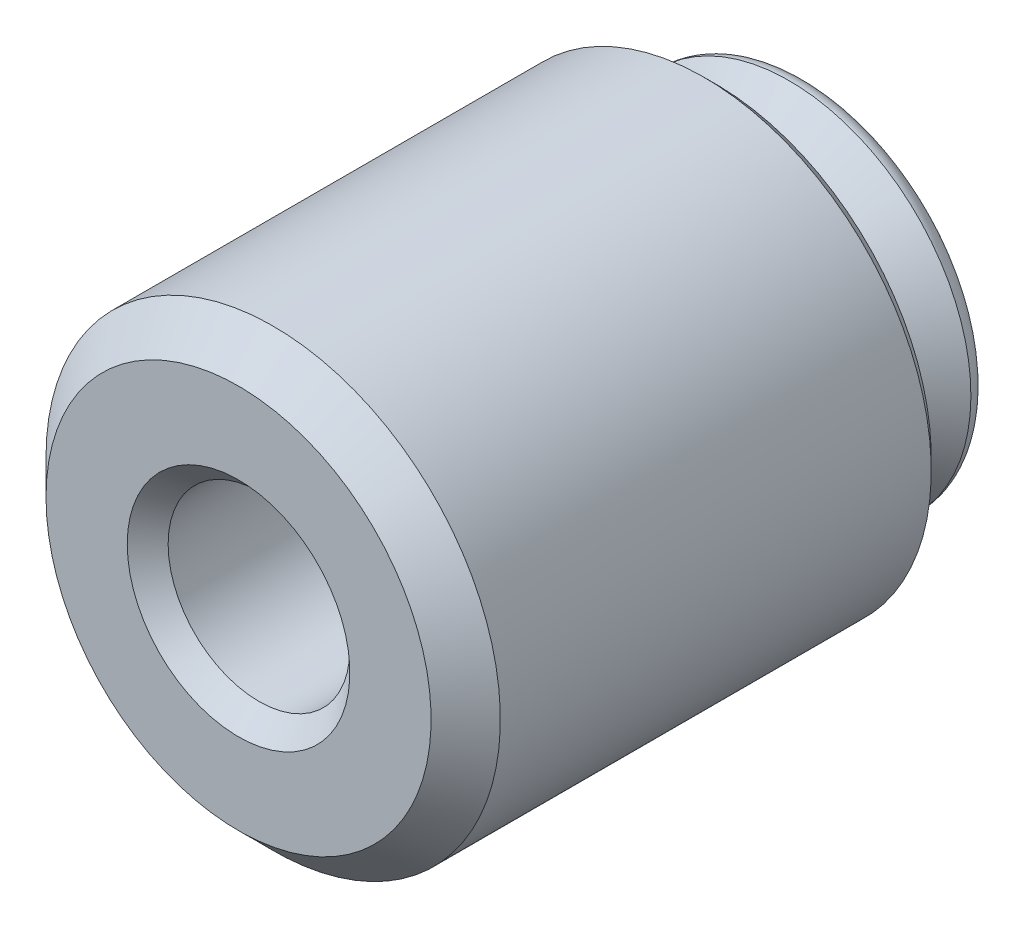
ISO-10303-21;
HEADER;
FILE_DESCRIPTION(('STEP AP214'),'2;1');
FILE_NAME('part.step','',(''),(''),'','','');
FILE_SCHEMA(('AUTOMOTIVE_DESIGN { 1 0 10303 214 1 1 1 1 }'));
ENDSEC;
DATA;
#1=APPLICATION_CONTEXT('core data for automotive mechanical design processes');
#2=APPLICATION_PROTOCOL_DEFINITION('international standard','automotive_design',2000,#1);
#3=PRODUCT_CONTEXT('',#1,'mechanical');
#4=PRODUCT('Part','Part','',(#3));
#5=PRODUCT_RELATED_PRODUCT_CATEGORY('part','',(#4));
#6=PRODUCT_DEFINITION_FORMATION('','',#4);
#7=PRODUCT_DEFINITION_CONTEXT('part definition',#1,'design');
#8=PRODUCT_DEFINITION('design','',#6,#7);
#9=PRODUCT_DEFINITION_SHAPE('','',#8);
#10=(LENGTH_UNIT() NAMED_UNIT(*) SI_UNIT(.MILLI.,.METRE.));
#11=(NAMED_UNIT(*) PLANE_ANGLE_UNIT() SI_UNIT($,.RADIAN.));
#12=(NAMED_UNIT(*) SI_UNIT($,.STERADIAN.) SOLID_ANGLE_UNIT());
#13=UNCERTAINTY_MEASURE_WITH_UNIT(LENGTH_MEASURE(1.E-05),#10,'distance_accuracy_value','');
#14=(GEOMETRIC_REPRESENTATION_CONTEXT(3) GLOBAL_UNCERTAINTY_ASSIGNED_CONTEXT((#13)) GLOBAL_UNIT_ASSIGNED_CONTEXT((#10,
#11,#12)) REPRESENTATION_CONTEXT('',''));
#15=CARTESIAN_POINT('',(0.,0.,0.));
#16=DIRECTION('',(0.,0.,1.));
#17=DIRECTION('',(1.,0.,0.));
#18=AXIS2_PLACEMENT_3D('',#15,#16,#17);
#19=CARTESIAN_POINT('',(0.,0.,4.0013999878));
#20=DIRECTION('',(0.,0.,-1.));
#21=DIRECTION('',(0.0518889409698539,0.99865286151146,0.));
#22=AXIS2_PLACEMENT_3D('',#19,#20,#21);
#23=SPHERICAL_SURFACE('',#22,3.5);
#24=CARTESIAN_POINT('',(0.,0.,2.6349999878));
#25=DIRECTION('',(0.,0.,-1.));
#26=DIRECTION('',(-1.,0.,0.));
#27=AXIS2_PLACEMENT_3D('',#24,#25,#26);
#28=CIRCLE('',#27,3.2222586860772);
#29=CARTESIAN_POINT('',(0.167199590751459,3.21791785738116,2.6349999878));
#30=VERTEX_POINT('',#29);
#31=EDGE_CURVE('E8',#30,#30,#28,.F.);
#32=CARTESIAN_POINT('',(0.,0.,2.25615730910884));
#33=DIRECTION('',(0.,0.,1.));
#34=DIRECTION('',(0.0518889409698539,0.99865286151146,0.));
#35=AXIS2_PLACEMENT_3D('',#32,#33,#34);
#36=CIRCLE('',#35,3.0338305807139);
#37=CARTESIAN_POINT('',(0.157422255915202,3.02974359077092,2.25615730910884));
#38=VERTEX_POINT('',#37);
#39=EDGE_CURVE('E39',#38,#38,#36,.T.);
#40=CARTESIAN_POINT('',(0.167199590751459,3.21791785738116,2.6349999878));
#41=CARTESIAN_POINT('',(0.167110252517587,3.21619845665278,2.63093980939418));
#42=CARTESIAN_POINT('',(0.167020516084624,3.2144713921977,2.62688288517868));
#43=CARTESIAN_POINT('',(0.166840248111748,3.21100196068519,2.61877560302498));
#44=CARTESIAN_POINT('',(0.166749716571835,3.20925959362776,2.61472524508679));
#45=CARTESIAN_POINT('',(0.166567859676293,3.20575958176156,2.60663115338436));
#46=CARTESIAN_POINT('',(0.166476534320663,3.20400193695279,2.60258741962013));
#47=CARTESIAN_POINT('',(0.166293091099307,3.20047139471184,2.59450663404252));
#48=CARTESIAN_POINT('',(0.166200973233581,3.19869849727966,2.59046958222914));
#49=CARTESIAN_POINT('',(0.16601594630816,3.19513747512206,2.58240221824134));
#50=CARTESIAN_POINT('',(0.165923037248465,3.19334935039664,2.57837190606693));
#51=CARTESIAN_POINT('',(0.165736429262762,3.18975789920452,2.57031807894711));
#52=CARTESIAN_POINT('',(0.165642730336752,3.18795457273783,2.56629456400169));
#53=CARTESIAN_POINT('',(0.1654545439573,3.18433274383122,2.55825438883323));
#54=CARTESIAN_POINT('',(0.165360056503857,3.18251424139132,2.55423772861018));
#55=CARTESIAN_POINT('',(0.165170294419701,3.17886208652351,2.54621132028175));
#56=CARTESIAN_POINT('',(0.165075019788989,3.17702843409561,2.54220157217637));
#57=CARTESIAN_POINT('',(0.164883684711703,3.17334600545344,2.53418904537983));
#58=CARTESIAN_POINT('',(0.164787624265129,3.17149722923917,2.53018626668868));
#59=CARTESIAN_POINT('',(0.164594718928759,3.167784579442,2.52218773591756));
#60=CARTESIAN_POINT('',(0.164497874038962,3.1659207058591,2.5181919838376));
#61=CARTESIAN_POINT('',(0.164303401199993,3.16217788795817,2.51020756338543));
#62=CARTESIAN_POINT('',(0.164205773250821,3.16029894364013,2.50621889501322));
#63=CARTESIAN_POINT('',(0.164009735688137,3.15652601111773,2.4982486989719));
#64=CARTESIAN_POINT('',(0.163911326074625,3.15463202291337,2.49426717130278));
#65=CARTESIAN_POINT('',(0.163713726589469,3.15082902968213,2.48631131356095));
#66=CARTESIAN_POINT('',(0.163614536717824,3.14892002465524,2.48233698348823));
#67=CARTESIAN_POINT('',(0.163415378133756,3.14508702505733,2.47439557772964));
#68=CARTESIAN_POINT('',(0.163315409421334,3.1431630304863,2.47042850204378));
#69=CARTESIAN_POINT('',(0.163114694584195,3.13930007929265,2.46250166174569));
#70=CARTESIAN_POINT('',(0.163013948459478,3.13736112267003,2.45854189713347));
#71=CARTESIAN_POINT('',(0.162811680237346,3.13346827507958,2.45062973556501));
#72=CARTESIAN_POINT('',(0.162710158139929,3.13151438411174,2.44667733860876));
#73=CARTESIAN_POINT('',(0.162506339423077,3.1275916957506,2.43877996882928));
#74=CARTESIAN_POINT('',(0.162404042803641,3.12562289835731,2.43483499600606));
#75=CARTESIAN_POINT('',(0.1621986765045,3.12167042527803,2.42695253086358));
#76=CARTESIAN_POINT('',(0.162095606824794,3.11968674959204,2.42301503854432));
#77=CARTESIAN_POINT('',(0.161888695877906,3.11570454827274,2.41514759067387));
#78=CARTESIAN_POINT('',(0.161784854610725,3.11370602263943,2.41121763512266));
#79=CARTESIAN_POINT('',(0.161576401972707,3.10969414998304,2.40336531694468));
#80=CARTESIAN_POINT('',(0.161471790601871,3.10768080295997,2.39944295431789));
#81=CARTESIAN_POINT('',(0.161261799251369,3.10363931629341,2.39160587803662));
#82=CARTESIAN_POINT('',(0.161156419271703,3.10161117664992,2.38769116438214));
#83=CARTESIAN_POINT('',(0.160944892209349,3.09754013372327,2.37986944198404));
#84=CARTESIAN_POINT('',(0.160838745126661,3.0954972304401,2.37596243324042));
#85=CARTESIAN_POINT('',(0.160625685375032,3.09139668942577,2.36815617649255));
#86=CARTESIAN_POINT('',(0.160518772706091,3.0893390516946,2.36425692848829));
#87=CARTESIAN_POINT('',(0.160304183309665,3.08520907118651,2.35646624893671));
#88=CARTESIAN_POINT('',(0.16019650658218,3.08313672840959,2.35257481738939));
#89=CARTESIAN_POINT('',(0.159980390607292,3.07897736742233,2.34479982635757));
#90=CARTESIAN_POINT('',(0.159871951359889,3.076890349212,2.34091626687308));
#91=CARTESIAN_POINT('',(0.15965431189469,3.07270166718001,2.33315707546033));
#92=CARTESIAN_POINT('',(0.159545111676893,3.07060000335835,2.32928144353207));
#93=CARTESIAN_POINT('',(0.159325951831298,3.06638206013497,2.32153816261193));
#94=CARTESIAN_POINT('',(0.1592159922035,3.06426578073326,2.31767051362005));
#95=CARTESIAN_POINT('',(0.158995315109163,3.0600186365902,2.30994325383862));
#96=CARTESIAN_POINT('',(0.158884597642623,3.05788777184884,2.30608364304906));
#97=CARTESIAN_POINT('',(0.158662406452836,3.05361148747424,2.29837251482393));
#98=CARTESIAN_POINT('',(0.158550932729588,3.051466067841,2.29452099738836));
#99=CARTESIAN_POINT('',(0.15832723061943,3.04716070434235,2.28682611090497));
#100=CARTESIAN_POINT('',(0.15821500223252,3.04500076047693,2.28298274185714));
#101=CARTESIAN_POINT('',(0.157989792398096,3.04066637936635,2.27530420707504));
#102=CARTESIAN_POINT('',(0.157876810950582,3.03849194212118,2.27146904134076));
#103=CARTESIAN_POINT('',(0.157650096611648,3.03412860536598,2.26380696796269));
#104=CARTESIAN_POINT('',(0.157536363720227,3.03193970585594,2.2599800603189));
#105=CARTESIAN_POINT('',(0.157422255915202,3.02974359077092,2.25615730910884));
#106=B_SPLINE_CURVE_WITH_KNOTS('',3,(#40,#41,#42,#43,#44,#45,#46,#47,#48,#49,#50,#51,#52,#53,
#54,#55,#56,#57,#58,#59,#60,#61,#62,#63,#64,#65,#66,#67,#68,#69,#70,#71,#72,#73,#74,#75,#76,#77,
#78,#79,#80,#81,#82,#83,#84,#85,#86,#87,#88,#89,#90,#91,#92,#93,#94,#95,#96,#97,#98,#99,#100,
#101,#102,#103,#104,#105),.UNSPECIFIED.,.F.,.F.,(4,2,2,2,2,2,2,2,2,2,2,2,2,2,2,2,2,2,2,2,2,2,2,
2,2,2,2,2,2,2,2,2,4),(0.,0.0132304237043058,0.0264608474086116,0.0396912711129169,
0.0529216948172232,0.0661521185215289,0.0793825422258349,0.0926129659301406,0.105843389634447,
0.119073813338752,0.132304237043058,0.145534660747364,0.158765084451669,0.171995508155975,
0.185225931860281,0.198456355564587,0.211686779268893,0.224917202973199,0.238147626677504,
0.25137805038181,0.264608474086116,0.277838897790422,0.291069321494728,0.304299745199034,
0.317530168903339,0.330760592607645,0.343991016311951,0.357221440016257,0.370451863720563,
0.383682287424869,0.396912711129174,0.41014313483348,0.423373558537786),.UNSPECIFIED.);
#107=EDGE_CURVE('BSEAM12',#30,#38,#106,.T.);
#108=ORIENTED_EDGE('',*,*,#31,.F.);
#109=ORIENTED_EDGE('',*,*,#39,.T.);
#110=ORIENTED_EDGE('',*,*,#107,.T.);
#111=ORIENTED_EDGE('',*,*,#107,.F.);
#112=EDGE_LOOP('',(#108,#110,#109,#111));
#113=FACE_BOUND('',#112,.T.);
#114=ADVANCED_FACE('F12',(#113),#23,.T.);
#115=CARTESIAN_POINT('',(0.,0.,0.));
#116=DIRECTION('',(0.,0.,-1.));
#117=DIRECTION('',(-0.0518889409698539,-0.99865286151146,0.));
#118=AXIS2_PLACEMENT_3D('',#115,#116,#117);
#119=CYLINDRICAL_SURFACE('',#118,3.);
#120=CARTESIAN_POINT('',(0.,0.,2.1295025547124));
#121=DIRECTION('',(0.,0.,1.));
#122=DIRECTION('',(0.0518889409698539,0.99865286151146,0.));
#123=AXIS2_PLACEMENT_3D('',#120,#121,#122);
#124=CIRCLE('',#123,3.);
#125=CARTESIAN_POINT('',(0.155666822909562,2.99595858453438,2.1295025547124));
#126=VERTEX_POINT('',#125);
#127=EDGE_CURVE('E37',#126,#126,#124,.F.);
#128=ORIENTED_EDGE('',*,*,#127,.T.);
#129=EDGE_LOOP('',(#128));
#130=FACE_BOUND('',#129,.T.);
#131=CARTESIAN_POINT('',(0.,0.,1.48621024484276));
#132=DIRECTION('',(0.,0.,-1.));
#133=DIRECTION('',(-0.0518889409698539,-0.99865286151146,0.));
#134=AXIS2_PLACEMENT_3D('',#131,#132,#133);
#135=CIRCLE('',#134,3.);
#136=CARTESIAN_POINT('',(-0.155666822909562,-2.99595858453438,1.48621024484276));
#137=VERTEX_POINT('',#136);
#138=EDGE_CURVE('E34',#137,#137,#135,.F.);
#139=ORIENTED_EDGE('',*,*,#138,.T.);
#140=EDGE_LOOP('',(#139));
#141=FACE_BOUND('',#140,.T.);
#142=ADVANCED_FACE('F245',(#130,#141),#119,.T.);
#143=CARTESIAN_POINT('',(0.,0.,1.381));
#144=DIRECTION('',(0.,0.,-1.));
#145=DIRECTION('',(-0.0518889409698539,-0.99865286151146,0.));
#146=AXIS2_PLACEMENT_3D('',#143,#144,#145);
#147=CONICAL_SURFACE('',#146,3.,0.78539816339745);
#148=CARTESIAN_POINT('',(0.,0.,1.30660512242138));
#149=DIRECTION('',(0.,0.,-1.));
#150=DIRECTION('',(-0.0518889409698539,-0.99865286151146,0.));
#151=AXIS2_PLACEMENT_3D('',#148,#149,#150);
#152=CIRCLE('',#151,3.07439487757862);
#153=CARTESIAN_POINT('',(-0.159527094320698,-3.07025324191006,1.30660512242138));
#154=VERTEX_POINT('',#153);
#155=EDGE_CURVE('E15',#154,#154,#152,.T.);
#156=ORIENTED_EDGE('',*,*,#155,.T.);
#157=EDGE_LOOP('',(#156));
#158=FACE_BOUND('',#157,.T.);
#159=CARTESIAN_POINT('',(0.,0.,0.381));
#160=DIRECTION('',(0.,0.,-1.));
#161=DIRECTION('',(-0.0518889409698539,-0.99865286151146,0.));
#162=AXIS2_PLACEMENT_3D('',#159,#160,#161);
#163=CIRCLE('',#162,4.);
#164=CARTESIAN_POINT('',(-0.207555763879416,-3.99461144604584,0.381));
#165=VERTEX_POINT('',#164);
#166=EDGE_CURVE('E28',#165,#165,#163,.T.);
#167=ORIENTED_EDGE('',*,*,#166,.F.);
#168=EDGE_LOOP('',(#167));
#169=FACE_BOUND('',#168,.T.);
#170=ADVANCED_FACE('F236',(#158,#169),#147,.T.);
#171=CARTESIAN_POINT('',(0.207555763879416,3.99461144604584,0.));
#172=DIRECTION('',(0.,0.,1.));
#173=DIRECTION('',(0.0518889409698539,0.99865286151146,0.));
#174=AXIS2_PLACEMENT_3D('',#171,#172,#173);
#175=PLANE('',#174);
#176=CARTESIAN_POINT('',(0.,0.,0.));
#177=DIRECTION('',(0.,0.,1.));
#178=DIRECTION('',(0.0518889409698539,0.99865286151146,0.));
#179=AXIS2_PLACEMENT_3D('',#176,#177,#178);
#180=CIRCLE('',#179,3.619);
#181=CARTESIAN_POINT('',(0.187786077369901,3.61412470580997,0.));
#182=VERTEX_POINT('',#181);
#183=EDGE_CURVE('E31',#182,#182,#180,.F.);
#184=ORIENTED_EDGE('',*,*,#183,.T.);
#185=EDGE_LOOP('',(#184));
#186=FACE_BOUND('',#185,.T.);
#187=ADVANCED_FACE('F227',(#186),#175,.F.);
#188=CARTESIAN_POINT('',(0.,0.,0.381));
#189=DIRECTION('',(0.,0.,1.));
#190=DIRECTION('',(0.0518889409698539,0.99865286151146,0.));
#191=AXIS2_PLACEMENT_3D('',#188,#189,#190);
#192=TOROIDAL_SURFACE('',#191,3.619,0.381);
#193=ORIENTED_EDGE('',*,*,#166,.T.);
#194=EDGE_LOOP('',(#193));
#195=FACE_BOUND('',#194,.T.);
#196=ORIENTED_EDGE('',*,*,#183,.F.);
#197=EDGE_LOOP('',(#196));
#198=FACE_BOUND('',#197,.T.);
#199=ADVANCED_FACE('F218',(#195,#198),#192,.T.);
#200=CARTESIAN_POINT('',(0.,0.,2.1295025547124));
#201=DIRECTION('',(0.,0.,1.));
#202=DIRECTION('',(0.0518889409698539,0.99865286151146,0.));
#203=AXIS2_PLACEMENT_3D('',#200,#201,#202);
#204=TOROIDAL_SURFACE('',#203,3.254,0.254);
#205=ORIENTED_EDGE('',*,*,#39,.F.);
#206=EDGE_LOOP('',(#205));
#207=FACE_BOUND('',#206,.T.);
#208=ORIENTED_EDGE('',*,*,#127,.F.);
#209=EDGE_LOOP('',(#208));
#210=FACE_BOUND('',#209,.T.);
#211=ADVANCED_FACE('F102',(#207,#210),#204,.F.);
#212=CARTESIAN_POINT('',(0.,0.,1.48621024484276));
#213=DIRECTION('',(0.,0.,-1.));
#214=DIRECTION('',(-0.0518889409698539,-0.99865286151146,0.));
#215=AXIS2_PLACEMENT_3D('',#212,#213,#214);
#216=TOROIDAL_SURFACE('',#215,3.254,0.254);
#217=ORIENTED_EDGE('',*,*,#138,.F.);
#218=EDGE_LOOP('',(#217));
#219=FACE_BOUND('',#218,.T.);
#220=ORIENTED_EDGE('',*,*,#155,.F.);
#221=EDGE_LOOP('',(#220));
#222=FACE_BOUND('',#221,.T.);
#223=ADVANCED_FACE('F97',(#219,#222),#216,.F.);
#224=CARTESIAN_POINT('',(0.,0.,8.9999999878));
#225=DIRECTION('',(0.,0.,1.));
#226=DIRECTION('',(1.,0.,0.));
#227=AXIS2_PLACEMENT_3D('',#224,#225,#226);
#228=PLANE('',#227);
#229=CARTESIAN_POINT('',(0.,0.,8.9999999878));
#230=DIRECTION('',(0.,0.,1.));
#231=DIRECTION('',(1.,0.,0.));
#232=AXIS2_PLACEMENT_3D('',#229,#230,#231);
#233=CIRCLE('',#232,2.);
#234=CARTESIAN_POINT('',(2.,0.,8.9999999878));
#235=VERTEX_POINT('',#234);
#236=EDGE_CURVE('E44',#235,#235,#233,.T.);
#237=ORIENTED_EDGE('',*,*,#236,.T.);
#238=EDGE_LOOP('',(#237));
#239=FACE_BOUND('',#238,.T.);
#240=ADVANCED_FACE('F91',(#239),#228,.T.);
#241=CARTESIAN_POINT('',(0.,0.,8.9999999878));
#242=DIRECTION('',(0.,0.,1.));
#243=DIRECTION('',(1.,0.,0.));
#244=AXIS2_PLACEMENT_3D('',#241,#242,#243);
#245=CYLINDRICAL_SURFACE('',#244,2.);
#246=CARTESIAN_POINT('',(0.,0.,12.0499999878));
#247=DIRECTION('',(0.,0.,-1.));
#248=DIRECTION('',(-1.,0.,0.));
#249=AXIS2_PLACEMENT_3D('',#246,#247,#248);
#250=CIRCLE('',#249,2.);
#251=CARTESIAN_POINT('',(-2.,0.,12.0499999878));
#252=VERTEX_POINT('',#251);
#253=EDGE_CURVE('E24',#252,#252,#250,.F.);
#254=ORIENTED_EDGE('',*,*,#253,.T.);
#255=EDGE_LOOP('',(#254));
#256=FACE_BOUND('',#255,.T.);
#257=ORIENTED_EDGE('',*,*,#236,.F.);
#258=EDGE_LOOP('',(#257));
#259=FACE_BOUND('',#258,.T.);
#260=ADVANCED_FACE('F75',(#256,#259),#245,.F.);
#261=CARTESIAN_POINT('',(0.,0.,12.0499999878));
#262=DIRECTION('',(0.,0.,1.));
#263=DIRECTION('',(1.,0.,0.));
#264=AXIS2_PLACEMENT_3D('',#261,#262,#263);
#265=CONICAL_SURFACE('',#264,2.,0.78539816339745);
#266=CARTESIAN_POINT('',(0.,0.,12.4999999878));
#267=DIRECTION('',(0.,0.,-1.));
#268=DIRECTION('',(-1.,0.,0.));
#269=AXIS2_PLACEMENT_3D('',#266,#267,#268);
#270=CIRCLE('',#269,2.45);
#271=CARTESIAN_POINT('',(-2.45,0.,12.4999999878));
#272=VERTEX_POINT('',#271);
#273=EDGE_CURVE('E19',#272,#272,#270,.T.);
#274=ORIENTED_EDGE('',*,*,#273,.F.);
#275=EDGE_LOOP('',(#274));
#276=FACE_BOUND('',#275,.T.);
#277=ORIENTED_EDGE('',*,*,#253,.F.);
#278=EDGE_LOOP('',(#277));
#279=FACE_BOUND('',#278,.T.);
#280=ADVANCED_FACE('F78',(#276,#279),#265,.F.);
#281=CARTESIAN_POINT('',(0.,0.,12.4999999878));
#282=DIRECTION('',(0.,0.,-1.));
#283=DIRECTION('',(-1.,0.,0.));
#284=AXIS2_PLACEMENT_3D('',#281,#282,#283);
#285=PLANE('',#284);
#286=ORIENTED_EDGE('',*,*,#273,.T.);
#287=EDGE_LOOP('',(#286));
#288=FACE_BOUND('',#287,.T.);
#289=CARTESIAN_POINT('',(0.,0.,12.4999999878));
#290=DIRECTION('',(0.,0.,-1.));
#291=DIRECTION('',(-1.,0.,0.));
#292=AXIS2_PLACEMENT_3D('',#289,#290,#291);
#293=CIRCLE('',#292,4.238);
#294=CARTESIAN_POINT('',(-4.238,0.,12.4999999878));
#295=VERTEX_POINT('',#294);
#296=EDGE_CURVE('E70',#295,#295,#293,.F.);
#297=ORIENTED_EDGE('',*,*,#296,.T.);
#298=EDGE_LOOP('',(#297));
#299=FACE_BOUND('',#298,.T.);
#300=ADVANCED_FACE('F80',(#288,#299),#285,.F.);
#301=CARTESIAN_POINT('',(0.,0.,11.7379999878));
#302=DIRECTION('',(0.,0.,-1.));
#303=DIRECTION('',(-1.,0.,0.));
#304=AXIS2_PLACEMENT_3D('',#301,#302,#303);
#305=CONICAL_SURFACE('',#304,5.,0.78539816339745);
#306=ORIENTED_EDGE('',*,*,#296,.F.);
#307=EDGE_LOOP('',(#306));
#308=FACE_BOUND('',#307,.T.);
#309=CARTESIAN_POINT('',(0.,0.,11.7379999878));
#310=DIRECTION('',(0.,0.,-1.));
#311=DIRECTION('',(-1.,0.,0.));
#312=AXIS2_PLACEMENT_3D('',#309,#310,#311);
#313=CIRCLE('',#312,5.);
#314=CARTESIAN_POINT('',(-5.,0.,11.7379999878));
#315=VERTEX_POINT('',#314);
#316=EDGE_CURVE('E67',#315,#315,#313,.T.);
#317=ORIENTED_EDGE('',*,*,#316,.F.);
#318=EDGE_LOOP('',(#317));
#319=FACE_BOUND('',#318,.T.);
#320=ADVANCED_FACE('F88',(#308,#319),#305,.T.);
#321=CARTESIAN_POINT('',(0.,0.,12.4999999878));
#322=DIRECTION('',(0.,0.,-1.));
#323=DIRECTION('',(-1.,0.,0.));
#324=AXIS2_PLACEMENT_3D('',#321,#322,#323);
#325=CYLINDRICAL_SURFACE('',#324,5.);
#326=ORIENTED_EDGE('',*,*,#316,.T.);
#327=EDGE_LOOP('',(#326));
#328=FACE_BOUND('',#327,.T.);
#329=CARTESIAN_POINT('',(0.,0.,2.2539999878));
#330=DIRECTION('',(0.,0.,-1.));
#331=DIRECTION('',(-1.,0.,0.));
#332=AXIS2_PLACEMENT_3D('',#329,#330,#331);
#333=CIRCLE('',#332,5.);
#334=CARTESIAN_POINT('',(-5.,0.,2.2539999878));
#335=VERTEX_POINT('',#334);
#336=EDGE_CURVE('E64',#335,#335,#333,.F.);
#337=ORIENTED_EDGE('',*,*,#336,.T.);
#338=EDGE_LOOP('',(#337));
#339=FACE_BOUND('',#338,.T.);
#340=ADVANCED_FACE('F119',(#328,#339),#325,.T.);
#341=CARTESIAN_POINT('',(0.,0.,1.9999999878));
#342=DIRECTION('',(0.,0.,1.));
#343=DIRECTION('',(1.,0.,0.));
#344=AXIS2_PLACEMENT_3D('',#341,#342,#343);
#345=CONICAL_SURFACE('',#344,4.746,0.785398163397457);
#346=ORIENTED_EDGE('',*,*,#336,.F.);
#347=EDGE_LOOP('',(#346));
#348=FACE_BOUND('',#347,.T.);
#349=CARTESIAN_POINT('',(0.,0.,1.9999999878));
#350=DIRECTION('',(0.,0.,-1.));
#351=DIRECTION('',(-1.,0.,0.));
#352=AXIS2_PLACEMENT_3D('',#349,#350,#351);
#353=CIRCLE('',#352,4.746);
#354=CARTESIAN_POINT('',(-4.746,0.,1.9999999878));
#355=VERTEX_POINT('',#354);
#356=EDGE_CURVE('E58',#355,#355,#353,.T.);
#357=ORIENTED_EDGE('',*,*,#356,.F.);
#358=EDGE_LOOP('',(#357));
#359=FACE_BOUND('',#358,.T.);
#360=ADVANCED_FACE('F117',(#348,#359),#345,.T.);
#361=CARTESIAN_POINT('',(0.,0.,1.9999999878));
#362=DIRECTION('',(0.,0.,-1.));
#363=DIRECTION('',(-1.,0.,0.));
#364=AXIS2_PLACEMENT_3D('',#361,#362,#363);
#365=PLANE('',#364);
#366=CARTESIAN_POINT('',(0.,0.,1.9999999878));
#367=DIRECTION('',(0.,0.,-1.));
#368=DIRECTION('',(-1.,0.,0.));
#369=AXIS2_PLACEMENT_3D('',#366,#367,#368);
#370=CIRCLE('',#369,3.8227);
#371=CARTESIAN_POINT('',(-3.8227,0.,1.9999999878));
#372=VERTEX_POINT('',#371);
#373=EDGE_CURVE('E61',#372,#372,#370,.F.);
#374=ORIENTED_EDGE('',*,*,#373,.T.);
#375=EDGE_LOOP('',(#374));
#376=FACE_BOUND('',#375,.T.);
#377=ORIENTED_EDGE('',*,*,#356,.T.);
#378=EDGE_LOOP('',(#377));
#379=FACE_BOUND('',#378,.T.);
#380=ADVANCED_FACE('F114',(#376,#379),#365,.T.);
#381=CARTESIAN_POINT('',(0.,0.,2.2539999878));
#382=DIRECTION('',(0.,0.,-1.));
#383=DIRECTION('',(-1.,0.,0.));
#384=AXIS2_PLACEMENT_3D('',#381,#382,#383);
#385=CONICAL_SURFACE('',#384,3.5687,0.785398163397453);
#386=ORIENTED_EDGE('',*,*,#373,.F.);
#387=EDGE_LOOP('',(#386));
#388=FACE_BOUND('',#387,.T.);
#389=CARTESIAN_POINT('',(0.,0.,2.2539999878));
#390=DIRECTION('',(0.,0.,-1.));
#391=DIRECTION('',(-1.,0.,0.));
#392=AXIS2_PLACEMENT_3D('',#389,#390,#391);
#393=CIRCLE('',#392,3.5687);
#394=CARTESIAN_POINT('',(-3.5687,0.,2.2539999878));
#395=VERTEX_POINT('',#394);
#396=EDGE_CURVE('E53',#395,#395,#393,.T.);
#397=ORIENTED_EDGE('',*,*,#396,.F.);
#398=EDGE_LOOP('',(#397));
#399=FACE_BOUND('',#398,.T.);
#400=ADVANCED_FACE('F111',(#388,#399),#385,.F.);
#401=CARTESIAN_POINT('',(0.,0.,5.3019999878));
#402=DIRECTION('',(0.,0.,-1.));
#403=DIRECTION('',(-1.,0.,0.));
#404=AXIS2_PLACEMENT_3D('',#401,#402,#403);
#405=CYLINDRICAL_SURFACE('',#404,3.5687);
#406=ORIENTED_EDGE('',*,*,#396,.T.);
#407=EDGE_LOOP('',(#406));
#408=FACE_BOUND('',#407,.T.);
#409=CARTESIAN_POINT('',(0.,0.,2.6349999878));
#410=DIRECTION('',(0.,0.,-1.));
#411=DIRECTION('',(-1.,0.,0.));
#412=AXIS2_PLACEMENT_3D('',#409,#410,#411);
#413=CIRCLE('',#412,3.5687);
#414=CARTESIAN_POINT('',(-3.5687,0.,2.6349999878));
#415=VERTEX_POINT('',#414);
#416=EDGE_CURVE('E48',#415,#415,#413,.F.);
#417=ORIENTED_EDGE('',*,*,#416,.T.);
#418=EDGE_LOOP('',(#417));
#419=FACE_BOUND('',#418,.T.);
#420=ADVANCED_FACE('F108',(#408,#419),#405,.F.);
#421=CARTESIAN_POINT('',(0.,0.,2.6349999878));
#422=DIRECTION('',(0.,0.,-1.));
#423=DIRECTION('',(-1.,0.,0.));
#424=AXIS2_PLACEMENT_3D('',#421,#422,#423);
#425=PLANE('',#424);
#426=ORIENTED_EDGE('',*,*,#416,.F.);
#427=EDGE_LOOP('',(#426));
#428=FACE_BOUND('',#427,.T.);
#429=ORIENTED_EDGE('',*,*,#31,.T.);
#430=EDGE_LOOP('',(#429));
#431=FACE_BOUND('',#430,.T.);
#432=ADVANCED_FACE('F105',(#428,#431),#425,.T.);
#433=CLOSED_SHELL('',(#114,#142,#170,#187,#199,#211,#223,#240,#260,#280,#300,#320,#340,#360,
#380,#400,#420,#432));
#434=MANIFOLD_SOLID_BREP('B1',#433);
#435=ADVANCED_BREP_SHAPE_REPRESENTATION('',(#18,#434),#14);
#436=SHAPE_DEFINITION_REPRESENTATION(#9,#435);
ENDSEC;
END-ISO-10303-21;
